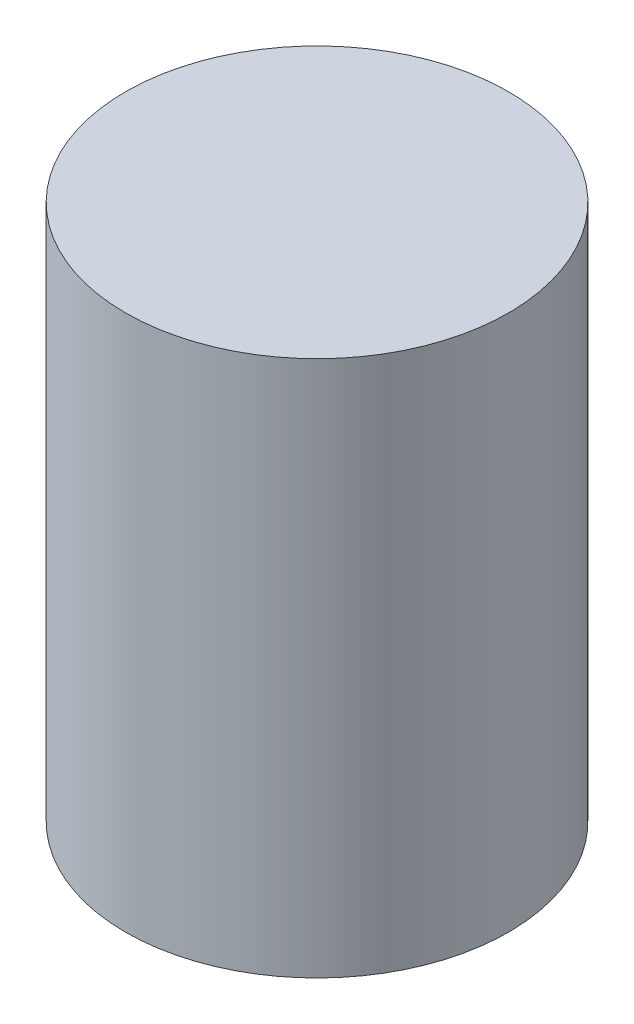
ISO-10303-21;
HEADER;
FILE_DESCRIPTION(('STEP AP214'),'2;1');
FILE_NAME('part.step','',(''),(''),'','','');
FILE_SCHEMA(('AUTOMOTIVE_DESIGN { 1 0 10303 214 1 1 1 1 }'));
ENDSEC;
DATA;
#1=APPLICATION_CONTEXT('core data for automotive mechanical design processes');
#2=APPLICATION_PROTOCOL_DEFINITION('international standard','automotive_design',2000,#1);
#3=PRODUCT_CONTEXT('',#1,'mechanical');
#4=PRODUCT('Part','Part','',(#3));
#5=PRODUCT_RELATED_PRODUCT_CATEGORY('part','',(#4));
#6=PRODUCT_DEFINITION_FORMATION('','',#4);
#7=PRODUCT_DEFINITION_CONTEXT('part definition',#1,'design');
#8=PRODUCT_DEFINITION('design','',#6,#7);
#9=PRODUCT_DEFINITION_SHAPE('','',#8);
#10=(LENGTH_UNIT() NAMED_UNIT(*) SI_UNIT(.MILLI.,.METRE.));
#11=(NAMED_UNIT(*) PLANE_ANGLE_UNIT() SI_UNIT($,.RADIAN.));
#12=(NAMED_UNIT(*) SI_UNIT($,.STERADIAN.) SOLID_ANGLE_UNIT());
#13=UNCERTAINTY_MEASURE_WITH_UNIT(LENGTH_MEASURE(1.E-05),#10,'distance_accuracy_value','');
#14=(GEOMETRIC_REPRESENTATION_CONTEXT(3) GLOBAL_UNCERTAINTY_ASSIGNED_CONTEXT((#13)) GLOBAL_UNIT_ASSIGNED_CONTEXT((#10,
#11,#12)) REPRESENTATION_CONTEXT('',''));
#15=CARTESIAN_POINT('',(0.,0.,0.));
#16=DIRECTION('',(0.,0.,1.));
#17=DIRECTION('',(1.,0.,0.));
#18=AXIS2_PLACEMENT_3D('',#15,#16,#17);
#19=CARTESIAN_POINT('',(0.,88.9,0.));
#20=DIRECTION('',(0.,-1.,0.));
#21=DIRECTION('',(0.,0.,-1.));
#22=AXIS2_PLACEMENT_3D('',#19,#20,#21);
#23=CYLINDRICAL_SURFACE('',#22,31.75);
#24=CARTESIAN_POINT('',(0.,88.9,0.));
#25=DIRECTION('',(0.,1.,0.));
#26=DIRECTION('',(0.,0.,1.));
#27=AXIS2_PLACEMENT_3D('',#24,#25,#26);
#28=CIRCLE('',#27,31.75);
#29=CARTESIAN_POINT('',(0.,88.9,31.75));
#30=VERTEX_POINT('',#29);
#31=EDGE_CURVE('E10',#30,#30,#28,.T.);
#32=ORIENTED_EDGE('',*,*,#31,.F.);
#33=EDGE_LOOP('',(#32));
#34=FACE_BOUND('',#33,.T.);
#35=CARTESIAN_POINT('',(0.,0.,0.));
#36=DIRECTION('',(0.,1.,0.));
#37=DIRECTION('',(0.,0.,1.));
#38=AXIS2_PLACEMENT_3D('',#35,#36,#37);
#39=CIRCLE('',#38,31.75);
#40=CARTESIAN_POINT('',(0.,0.,31.75));
#41=VERTEX_POINT('',#40);
#42=EDGE_CURVE('E28',#41,#41,#39,.T.);
#43=ORIENTED_EDGE('',*,*,#42,.T.);
#44=EDGE_LOOP('',(#43));
#45=FACE_BOUND('',#44,.T.);
#46=ADVANCED_FACE('F22',(#34,#45),#23,.T.);
#47=CARTESIAN_POINT('',(0.,88.9,0.));
#48=DIRECTION('',(0.,1.,0.));
#49=DIRECTION('',(0.,0.,1.));
#50=AXIS2_PLACEMENT_3D('',#47,#48,#49);
#51=PLANE('',#50);
#52=ORIENTED_EDGE('',*,*,#31,.T.);
#53=EDGE_LOOP('',(#52));
#54=FACE_BOUND('',#53,.T.);
#55=ADVANCED_FACE('F37',(#54),#51,.T.);
#56=CARTESIAN_POINT('',(0.,0.,0.));
#57=DIRECTION('',(0.,1.,0.));
#58=DIRECTION('',(0.,0.,1.));
#59=AXIS2_PLACEMENT_3D('',#56,#57,#58);
#60=PLANE('',#59);
#61=ORIENTED_EDGE('',*,*,#42,.F.);
#62=EDGE_LOOP('',(#61));
#63=FACE_BOUND('',#62,.T.);
#64=ADVANCED_FACE('F35',(#63),#60,.F.);
#65=CLOSED_SHELL('',(#46,#55,#64));
#66=MANIFOLD_SOLID_BREP('B2',#65);
#67=ADVANCED_BREP_SHAPE_REPRESENTATION('',(#18,#66),#14);
#68=SHAPE_DEFINITION_REPRESENTATION(#9,#67);
ENDSEC;
END-ISO-10303-21;
